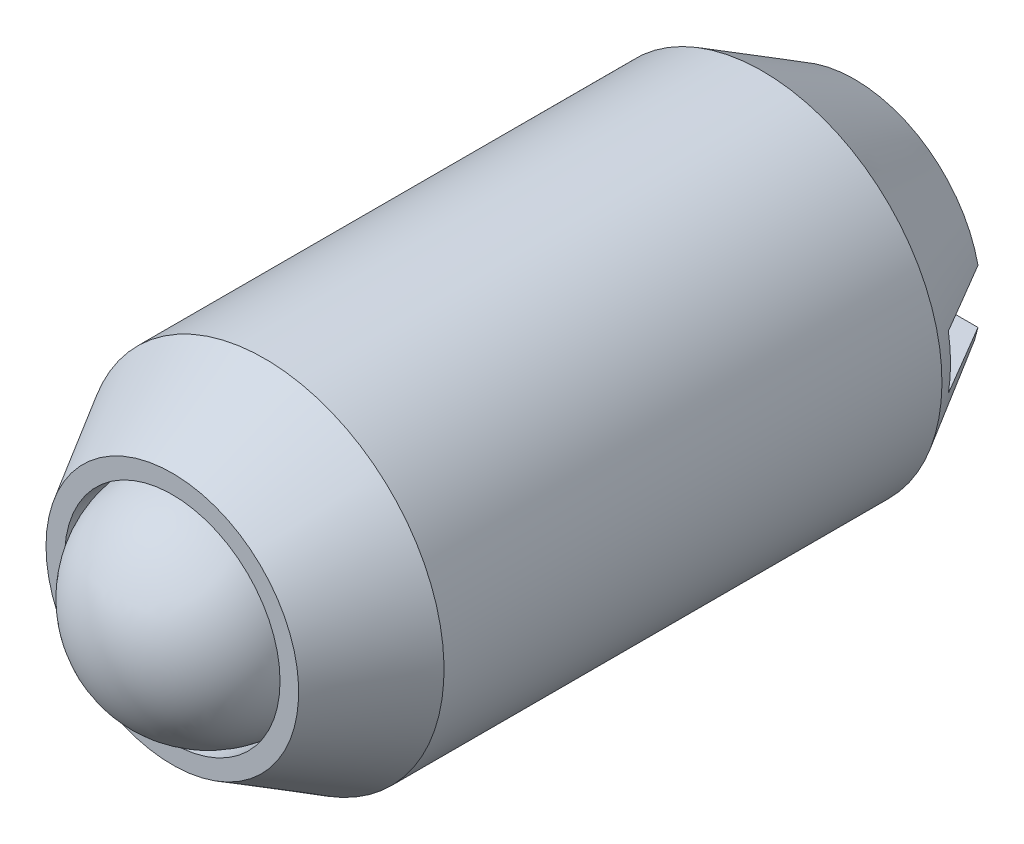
ISO-10303-21;
HEADER;
FILE_DESCRIPTION(('STEP AP214'),'2;1');
FILE_NAME('part.step','',(''),(''),'','','');
FILE_SCHEMA(('AUTOMOTIVE_DESIGN { 1 0 10303 214 1 1 1 1 }'));
ENDSEC;
DATA;
#1=APPLICATION_CONTEXT('core data for automotive mechanical design processes');
#2=APPLICATION_PROTOCOL_DEFINITION('international standard','automotive_design',2000,#1);
#3=PRODUCT_CONTEXT('',#1,'mechanical');
#4=PRODUCT('Part','Part','',(#3));
#5=PRODUCT_RELATED_PRODUCT_CATEGORY('part','',(#4));
#6=PRODUCT_DEFINITION_FORMATION('','',#4);
#7=PRODUCT_DEFINITION_CONTEXT('part definition',#1,'design');
#8=PRODUCT_DEFINITION('design','',#6,#7);
#9=PRODUCT_DEFINITION_SHAPE('','',#8);
#10=(LENGTH_UNIT() NAMED_UNIT(*) SI_UNIT(.MILLI.,.METRE.));
#11=(NAMED_UNIT(*) PLANE_ANGLE_UNIT() SI_UNIT($,.RADIAN.));
#12=(NAMED_UNIT(*) SI_UNIT($,.STERADIAN.) SOLID_ANGLE_UNIT());
#13=UNCERTAINTY_MEASURE_WITH_UNIT(LENGTH_MEASURE(1.E-05),#10,'distance_accuracy_value','');
#14=(GEOMETRIC_REPRESENTATION_CONTEXT(3) GLOBAL_UNCERTAINTY_ASSIGNED_CONTEXT((#13)) GLOBAL_UNIT_ASSIGNED_CONTEXT((#10,
#11,#12)) REPRESENTATION_CONTEXT('',''));
#15=CARTESIAN_POINT('',(0.,0.,0.));
#16=DIRECTION('',(0.,0.,1.));
#17=DIRECTION('',(1.,0.,0.));
#18=AXIS2_PLACEMENT_3D('',#15,#16,#17);
#19=CARTESIAN_POINT('',(-3.00000000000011,-1.11022302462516E-13,18.));
#20=CARTESIAN_POINT('',(-3.00000000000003,-6.00000000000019,18.));
#21=CARTESIAN_POINT('',(3.00000000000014,-6.00000000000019,18.));
#22=CARTESIAN_POINT('',(3.00000000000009,0.,18.));
#23=(BOUNDED_CURVE() B_SPLINE_CURVE(3,(#19,#20,#21,#22),.UNSPECIFIED.,.F.,
.F.) B_SPLINE_CURVE_WITH_KNOTS((4,4),(0.,1.),
.UNSPECIFIED.) CURVE() GEOMETRIC_REPRESENTATION_ITEM() RATIONAL_B_SPLINE_CURVE((1.,
0.333333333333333,0.333333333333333,1.)) REPRESENTATION_ITEM(''));
#24=CARTESIAN_POINT('',(0.,0.,18.));
#25=DIRECTION('',(1.00000000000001,0.,0.));
#26=AXIS1_PLACEMENT('',#24,#25);
#27=SURFACE_OF_REVOLUTION('',#23,#26);
#28=CARTESIAN_POINT('',(0.,0.,18.));
#29=DIRECTION('',(0.,0.,1.));
#30=DIRECTION('',(0.,-1.00000000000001,0.));
#31=AXIS2_PLACEMENT_3D('',#28,#29,#30);
#32=CIRCLE('',#31,3.);
#33=CARTESIAN_POINT('',(-3.00000000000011,-1.11022302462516E-13,18.));
#34=VERTEX_POINT('',#33);
#35=CARTESIAN_POINT('',(3.00000000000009,0.,18.));
#36=VERTEX_POINT('',#35);
#37=EDGE_CURVE('E72',#34,#36,#32,.T.);
#38=ORIENTED_EDGE('',*,*,#37,.T.);
#39=CARTESIAN_POINT('',(0.,0.,18.));
#40=DIRECTION('',(0.,0.,1.));
#41=DIRECTION('',(0.,-1.00000000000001,0.));
#42=AXIS2_PLACEMENT_3D('',#39,#40,#41);
#43=CIRCLE('',#42,3.);
#44=EDGE_CURVE('E192',#36,#34,#43,.T.);
#45=ORIENTED_EDGE('',*,*,#44,.T.);
#46=EDGE_LOOP('',(#38,#45));
#47=FACE_BOUND('',#46,.T.);
#48=ADVANCED_FACE('F16',(#47),#27,.T.);
#49=CARTESIAN_POINT('',(0.,0.,18.));
#50=DIRECTION('',(0.,0.,1.));
#51=DIRECTION('',(1.00000000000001,0.,0.));
#52=AXIS2_PLACEMENT_3D('',#49,#50,#51);
#53=CYLINDRICAL_SURFACE('',#52,3.);
#54=CARTESIAN_POINT('',(0.,0.,19.));
#55=DIRECTION('',(0.,0.,1.));
#56=DIRECTION('',(1.00000000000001,0.,0.));
#57=AXIS2_PLACEMENT_3D('',#54,#55,#56);
#58=CIRCLE('',#57,3.);
#59=CARTESIAN_POINT('',(3.00000000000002,0.,19.));
#60=VERTEX_POINT('',#59);
#61=EDGE_CURVE('E71',#60,#60,#58,.T.);
#62=ORIENTED_EDGE('',*,*,#61,.T.);
#63=EDGE_LOOP('',(#62));
#64=FACE_BOUND('',#63,.T.);
#65=ORIENTED_EDGE('',*,*,#37,.F.);
#66=ORIENTED_EDGE('',*,*,#44,.F.);
#67=EDGE_LOOP('',(#65,#66));
#68=FACE_BOUND('',#67,.T.);
#69=ADVANCED_FACE('F175',(#64,#68),#53,.F.);
#70=CARTESIAN_POINT('',(-4.76648923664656,-0.750000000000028,2.));
#71=DIRECTION('',(0.,0.,1.));
#72=DIRECTION('',(1.00000000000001,0.,0.));
#73=AXIS2_PLACEMENT_3D('',#70,#71,#72);
#74=PLANE('',#73);
#75=CARTESIAN_POINT('',(0.,0.,1.99999999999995));
#76=DIRECTION('',(0.,0.,1.));
#77=DIRECTION('',(1.00000000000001,0.,0.));
#78=AXIS2_PLACEMENT_3D('',#75,#76,#77);
#79=CIRCLE('',#78,4.67302866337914);
#80=CARTESIAN_POINT('',(4.61245020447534,0.74999999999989,1.99999999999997));
#81=VERTEX_POINT('',#80);
#82=CARTESIAN_POINT('',(4.61245020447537,-0.750000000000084,1.99999999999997));
#83=VERTEX_POINT('',#82);
#84=EDGE_CURVE('E76',#81,#83,#79,.F.);
#85=ORIENTED_EDGE('',*,*,#84,.T.);
#86=DIRECTION('',(-1.00000000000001,0.,0.));
#87=VECTOR('',#86,1.);
#88=CARTESIAN_POINT('',(2.4980018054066E-12,-0.750000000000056,2.));
#89=LINE('',#88,#87);
#90=CARTESIAN_POINT('',(-4.6124502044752,-0.750000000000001,1.99999999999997));
#91=VERTEX_POINT('',#90);
#92=EDGE_CURVE('E74',#83,#91,#89,.T.);
#93=ORIENTED_EDGE('',*,*,#92,.T.);
#94=CARTESIAN_POINT('',(0.,0.,1.99999999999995));
#95=DIRECTION('',(0.,0.,1.));
#96=DIRECTION('',(1.00000000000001,0.,0.));
#97=AXIS2_PLACEMENT_3D('',#94,#95,#96);
#98=CIRCLE('',#97,4.67302866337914);
#99=CARTESIAN_POINT('',(-4.61245020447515,0.749999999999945,1.99999999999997));
#100=VERTEX_POINT('',#99);
#101=EDGE_CURVE('E21',#100,#91,#98,.T.);
#102=ORIENTED_EDGE('',*,*,#101,.F.);
#103=DIRECTION('',(1.00000000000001,0.,0.));
#104=VECTOR('',#103,1.);
#105=CARTESIAN_POINT('',(-2.4980018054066E-12,0.750000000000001,2.));
#106=LINE('',#105,#104);
#107=EDGE_CURVE('E160',#100,#81,#106,.T.);
#108=ORIENTED_EDGE('',*,*,#107,.T.);
#109=EDGE_LOOP('',(#85,#93,#102,#108));
#110=FACE_BOUND('',#109,.T.);
#111=ADVANCED_FACE('F75',(#110),#74,.F.);
#112=CARTESIAN_POINT('',(-3.5886946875,3.518328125,19.));
#113=DIRECTION('',(0.,0.,1.));
#114=DIRECTION('',(0.,-1.00000000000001,0.));
#115=AXIS2_PLACEMENT_3D('',#112,#113,#114);
#116=PLANE('',#115);
#117=ORIENTED_EDGE('',*,*,#61,.F.);
#118=EDGE_LOOP('',(#117));
#119=FACE_BOUND('',#118,.T.);
#120=CARTESIAN_POINT('',(0.,0.,19.));
#121=DIRECTION('',(0.,0.,-1.));
#122=DIRECTION('',(-1.00000000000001,0.,0.));
#123=AXIS2_PLACEMENT_3D('',#120,#121,#122);
#124=CIRCLE('',#123,3.518328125);
#125=CARTESIAN_POINT('',(-3.51832812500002,0.,19.));
#126=VERTEX_POINT('',#125);
#127=EDGE_CURVE('E78',#126,#126,#124,.F.);
#128=ORIENTED_EDGE('',*,*,#127,.T.);
#129=EDGE_LOOP('',(#128));
#130=FACE_BOUND('',#129,.T.);
#131=ADVANCED_FACE('F129',(#119,#130),#116,.T.);
#132=CARTESIAN_POINT('',(4.61245020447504,0.749999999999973,0.));
#133=DIRECTION('',(0.,1.00000000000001,0.));
#134=DIRECTION('',(-1.00000000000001,0.,0.));
#135=AXIS2_PLACEMENT_3D('',#132,#133,#134);
#136=PLANE('',#135);
#137=CARTESIAN_POINT('',(3.43746022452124,0.750000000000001,0.));
#138=CARTESIAN_POINT('',(3.53579832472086,0.749999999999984,0.166418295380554));
#139=CARTESIAN_POINT('',(3.63400021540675,0.749999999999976,0.332916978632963));
#140=CARTESIAN_POINT('',(3.83017960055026,0.749999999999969,0.666046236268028));
#141=CARTESIAN_POINT('',(3.92815709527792,0.749999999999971,0.832676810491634));
#142=CARTESIAN_POINT('',(4.1239359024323,0.749999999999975,1.16604128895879));
#143=CARTESIAN_POINT('',(4.2217372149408,0.749999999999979,1.33277519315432));
#144=CARTESIAN_POINT('',(4.41719478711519,0.749999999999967,1.66632827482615));
#145=CARTESIAN_POINT('',(4.51485104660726,0.749999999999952,1.83314745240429));
#146=CARTESIAN_POINT('',(4.61245020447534,0.749999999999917,1.99999999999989));
#147=B_SPLINE_CURVE_WITH_KNOTS('',3,(#137,#138,#139,#140,#141,#142,#143,#144,#145,#146),
.UNSPECIFIED.,.F.,.F.,(4,2,2,2,4),(0.,0.579904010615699,1.15980732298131,1.73971036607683,
2.31961410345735),.UNSPECIFIED.);
#148=CARTESIAN_POINT('',(3.43746022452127,0.750000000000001,0.));
#149=VERTEX_POINT('',#148);
#150=EDGE_CURVE('E117',#149,#81,#147,.T.);
#151=ORIENTED_EDGE('',*,*,#150,.T.);
#152=ORIENTED_EDGE('',*,*,#107,.F.);
#153=CARTESIAN_POINT('',(-4.61245020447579,0.749999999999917,2.00000000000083));
#154=CARTESIAN_POINT('',(-4.51485104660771,0.749999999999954,1.83314745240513));
#155=CARTESIAN_POINT('',(-4.41719478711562,0.749999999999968,1.6663282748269));
#156=CARTESIAN_POINT('',(-4.22173721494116,0.749999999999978,1.33277519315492));
#157=CARTESIAN_POINT('',(-4.12393590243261,0.749999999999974,1.16604128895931));
#158=CARTESIAN_POINT('',(-3.92815709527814,0.749999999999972,0.832676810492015));
#159=CARTESIAN_POINT('',(-3.83017960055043,0.749999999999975,0.666046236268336));
#160=CARTESIAN_POINT('',(-3.63400021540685,0.749999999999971,0.332916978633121));
#161=CARTESIAN_POINT('',(-3.53579832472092,0.749999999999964,0.166418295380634));
#162=CARTESIAN_POINT('',(-3.43746022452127,0.749999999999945,0.));
#163=B_SPLINE_CURVE_WITH_KNOTS('',3,(#153,#154,#155,#156,#157,#158,#159,#160,#161,#162),
.UNSPECIFIED.,.F.,.F.,(4,2,2,2,4),(0.,0.579903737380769,1.15980678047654,1.73971009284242,
2.31961410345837),.UNSPECIFIED.);
#164=CARTESIAN_POINT('',(-3.43746022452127,0.749999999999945,0.));
#165=VERTEX_POINT('',#164);
#166=EDGE_CURVE('E70',#100,#165,#163,.T.);
#167=ORIENTED_EDGE('',*,*,#166,.T.);
#168=DIRECTION('',(1.00000000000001,0.,0.));
#169=VECTOR('',#168,1.);
#170=CARTESIAN_POINT('',(0.,0.749999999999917,0.));
#171=LINE('',#170,#169);
#172=EDGE_CURVE('E158',#165,#149,#171,.T.);
#173=ORIENTED_EDGE('',*,*,#172,.T.);
#174=EDGE_LOOP('',(#151,#152,#167,#173));
#175=FACE_BOUND('',#174,.T.);
#176=ADVANCED_FACE('F123',(#175),#136,.F.);
#177=CARTESIAN_POINT('',(-3.43746022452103,3.51832812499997,0.));
#178=DIRECTION('',(0.,0.,1.));
#179=DIRECTION('',(0.,-1.00000000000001,0.));
#180=AXIS2_PLACEMENT_3D('',#177,#178,#179);
#181=PLANE('',#180);
#182=CARTESIAN_POINT('',(0.,0.,0.));
#183=DIRECTION('',(0.,0.,1.));
#184=DIRECTION('',(1.00000000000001,0.,0.));
#185=AXIS2_PLACEMENT_3D('',#182,#183,#184);
#186=CIRCLE('',#185,3.518328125);
#187=EDGE_CURVE('E85',#165,#149,#186,.F.);
#188=ORIENTED_EDGE('',*,*,#187,.T.);
#189=ORIENTED_EDGE('',*,*,#172,.F.);
#190=EDGE_LOOP('',(#188,#189));
#191=FACE_BOUND('',#190,.T.);
#192=ADVANCED_FACE('F128',(#191),#181,.F.);
#193=CARTESIAN_POINT('',(-3.43746022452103,3.51832812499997,0.));
#194=DIRECTION('',(0.,0.,1.));
#195=DIRECTION('',(0.,-1.00000000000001,0.));
#196=AXIS2_PLACEMENT_3D('',#193,#194,#195);
#197=PLANE('',#196);
#198=CARTESIAN_POINT('',(0.,0.,0.));
#199=DIRECTION('',(0.,0.,1.));
#200=DIRECTION('',(1.00000000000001,0.,0.));
#201=AXIS2_PLACEMENT_3D('',#198,#199,#200);
#202=CIRCLE('',#201,3.518328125);
#203=CARTESIAN_POINT('',(3.43746022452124,-0.750000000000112,0.));
#204=VERTEX_POINT('',#203);
#205=CARTESIAN_POINT('',(-3.43746022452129,-0.750000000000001,0.));
#206=VERTEX_POINT('',#205);
#207=EDGE_CURVE('E81',#204,#206,#202,.F.);
#208=ORIENTED_EDGE('',*,*,#207,.T.);
#209=DIRECTION('',(1.00000000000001,0.,0.));
#210=VECTOR('',#209,1.);
#211=CARTESIAN_POINT('',(2.4980018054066E-12,-0.750000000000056,0.));
#212=LINE('',#211,#210);
#213=EDGE_CURVE('E36',#206,#204,#212,.T.);
#214=ORIENTED_EDGE('',*,*,#213,.T.);
#215=EDGE_LOOP('',(#208,#214));
#216=FACE_BOUND('',#215,.T.);
#217=ADVANCED_FACE('F134',(#216),#197,.F.);
#218=CARTESIAN_POINT('',(-4.61245020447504,-0.750000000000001,0.));
#219=DIRECTION('',(0.,-1.00000000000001,0.));
#220=DIRECTION('',(1.00000000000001,0.,0.));
#221=AXIS2_PLACEMENT_3D('',#218,#219,#220);
#222=PLANE('',#221);
#223=CARTESIAN_POINT('',(3.43746022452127,-0.750000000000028,-1.11022302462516E-13));
#224=CARTESIAN_POINT('',(3.53579832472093,-0.75000000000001,0.166418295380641));
#225=CARTESIAN_POINT('',(3.63400021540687,-0.750000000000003,0.332916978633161));
#226=CARTESIAN_POINT('',(3.83017960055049,-0.749999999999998,0.666046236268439));
#227=CARTESIAN_POINT('',(3.92815709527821,-0.750000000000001,0.832676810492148));
#228=CARTESIAN_POINT('',(4.12393590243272,-0.750000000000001,1.1660412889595));
#229=CARTESIAN_POINT('',(4.22173721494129,-0.749999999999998,1.33277519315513));
#230=CARTESIAN_POINT('',(4.41719478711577,-0.750000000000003,1.66632827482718));
#231=CARTESIAN_POINT('',(4.51485104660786,-0.75000000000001,1.83314745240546));
#232=CARTESIAN_POINT('',(4.6124502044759,-0.750000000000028,2.00000000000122));
#233=B_SPLINE_CURVE_WITH_KNOTS('',3,(#223,#224,#225,#226,#227,#228,#229,#230,#231,#232),
.UNSPECIFIED.,.F.,.F.,(4,2,2,2,4),(0.,0.579904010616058,1.15980732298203,1.73971036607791,
2.31961410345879),.UNSPECIFIED.);
#234=EDGE_CURVE('E79',#204,#83,#233,.T.);
#235=ORIENTED_EDGE('',*,*,#234,.F.);
#236=ORIENTED_EDGE('',*,*,#213,.F.);
#237=CARTESIAN_POINT('',(-3.43746022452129,-0.750000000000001,0.));
#238=CARTESIAN_POINT('',(-3.53579832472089,-0.749999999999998,0.166418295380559));
#239=CARTESIAN_POINT('',(-3.63400021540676,-0.749999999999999,0.332916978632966));
#240=CARTESIAN_POINT('',(-3.83017960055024,-0.750000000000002,0.666046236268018));
#241=CARTESIAN_POINT('',(-3.92815709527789,-0.750000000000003,0.832676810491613));
#242=CARTESIAN_POINT('',(-4.12393590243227,-0.749999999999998,1.16604128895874));
#243=CARTESIAN_POINT('',(-4.22173721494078,-0.749999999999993,1.33277519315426));
#244=CARTESIAN_POINT('',(-4.41719478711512,-0.750000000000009,1.66632827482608));
#245=CARTESIAN_POINT('',(-4.51485104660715,-0.750000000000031,1.83314745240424));
#246=CARTESIAN_POINT('',(-4.61245020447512,-0.750000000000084,1.99999999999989));
#247=B_SPLINE_CURVE_WITH_KNOTS('',3,(#237,#238,#239,#240,#241,#242,#243,#244,#245,#246),
.UNSPECIFIED.,.F.,.F.,(4,2,2,2,4),(0.,0.579904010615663,1.15980732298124,1.73971036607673,
2.31961410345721),.UNSPECIFIED.);
#248=EDGE_CURVE('E66',#206,#91,#247,.T.);
#249=ORIENTED_EDGE('',*,*,#248,.T.);
#250=ORIENTED_EDGE('',*,*,#92,.F.);
#251=EDGE_LOOP('',(#235,#236,#249,#250));
#252=FACE_BOUND('',#251,.T.);
#253=ADVANCED_FACE('F18',(#252),#222,.F.);
#254=CARTESIAN_POINT('',(0.,0.,16.43366903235));
#255=DIRECTION('',(0.,0.,-1.));
#256=DIRECTION('',(-1.00000000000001,0.,0.));
#257=AXIS2_PLACEMENT_3D('',#254,#255,#256);
#258=CONICAL_SURFACE('',#257,5.,0.523598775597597);
#259=ORIENTED_EDGE('',*,*,#127,.F.);
#260=EDGE_LOOP('',(#259));
#261=FACE_BOUND('',#260,.T.);
#262=CARTESIAN_POINT('',(0.,0.,16.43366903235));
#263=DIRECTION('',(0.,0.,1.));
#264=DIRECTION('',(0.,-1.00000000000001,0.));
#265=AXIS2_PLACEMENT_3D('',#262,#263,#264);
#266=CIRCLE('',#265,5.);
#267=CARTESIAN_POINT('',(0.,-5.00000000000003,16.43366903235));
#268=VERTEX_POINT('',#267);
#269=EDGE_CURVE('E27',#268,#268,#266,.T.);
#270=ORIENTED_EDGE('',*,*,#269,.T.);
#271=EDGE_LOOP('',(#270));
#272=FACE_BOUND('',#271,.T.);
#273=ADVANCED_FACE('F100',(#261,#272),#258,.T.);
#274=CARTESIAN_POINT('',(0.,0.,0.));
#275=DIRECTION('',(0.,0.,1.));
#276=DIRECTION('',(1.00000000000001,0.,0.));
#277=AXIS2_PLACEMENT_3D('',#274,#275,#276);
#278=CONICAL_SURFACE('',#277,3.518328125,0.523598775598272);
#279=CARTESIAN_POINT('',(0.,0.,2.566330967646));
#280=DIRECTION('',(0.,0.,1.));
#281=DIRECTION('',(0.,-1.00000000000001,0.));
#282=AXIS2_PLACEMENT_3D('',#279,#280,#281);
#283=CIRCLE('',#282,5.);
#284=CARTESIAN_POINT('',(0.,-5.00000000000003,2.566330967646));
#285=VERTEX_POINT('',#284);
#286=EDGE_CURVE('E11',#285,#285,#283,.F.);
#287=ORIENTED_EDGE('',*,*,#286,.T.);
#288=EDGE_LOOP('',(#287));
#289=FACE_BOUND('',#288,.T.);
#290=ORIENTED_EDGE('',*,*,#207,.F.);
#291=ORIENTED_EDGE('',*,*,#234,.T.);
#292=ORIENTED_EDGE('',*,*,#84,.F.);
#293=ORIENTED_EDGE('',*,*,#150,.F.);
#294=ORIENTED_EDGE('',*,*,#187,.F.);
#295=ORIENTED_EDGE('',*,*,#166,.F.);
#296=ORIENTED_EDGE('',*,*,#101,.T.);
#297=ORIENTED_EDGE('',*,*,#248,.F.);
#298=EDGE_LOOP('',(#290,#291,#292,#293,#294,#295,#296,#297));
#299=FACE_BOUND('',#298,.T.);
#300=ADVANCED_FACE('F65',(#289,#299),#278,.T.);
#301=CARTESIAN_POINT('',(0.,0.,2.566330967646));
#302=DIRECTION('',(0.,0.,1.));
#303=DIRECTION('',(1.00000000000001,0.,0.));
#304=AXIS2_PLACEMENT_3D('',#301,#302,#303);
#305=CYLINDRICAL_SURFACE('',#304,5.);
#306=ORIENTED_EDGE('',*,*,#269,.F.);
#307=EDGE_LOOP('',(#306));
#308=FACE_BOUND('',#307,.T.);
#309=ORIENTED_EDGE('',*,*,#286,.F.);
#310=EDGE_LOOP('',(#309));
#311=FACE_BOUND('',#310,.T.);
#312=ADVANCED_FACE('F99',(#308,#311),#305,.T.);
#313=CLOSED_SHELL('',(#48,#69,#111,#131,#176,#192,#217,#253,#273,#300,#312));
#314=MANIFOLD_SOLID_BREP('B1',#313);
#315=ADVANCED_BREP_SHAPE_REPRESENTATION('',(#18,#314),#14);
#316=SHAPE_DEFINITION_REPRESENTATION(#9,#315);
ENDSEC;
END-ISO-10303-21;
